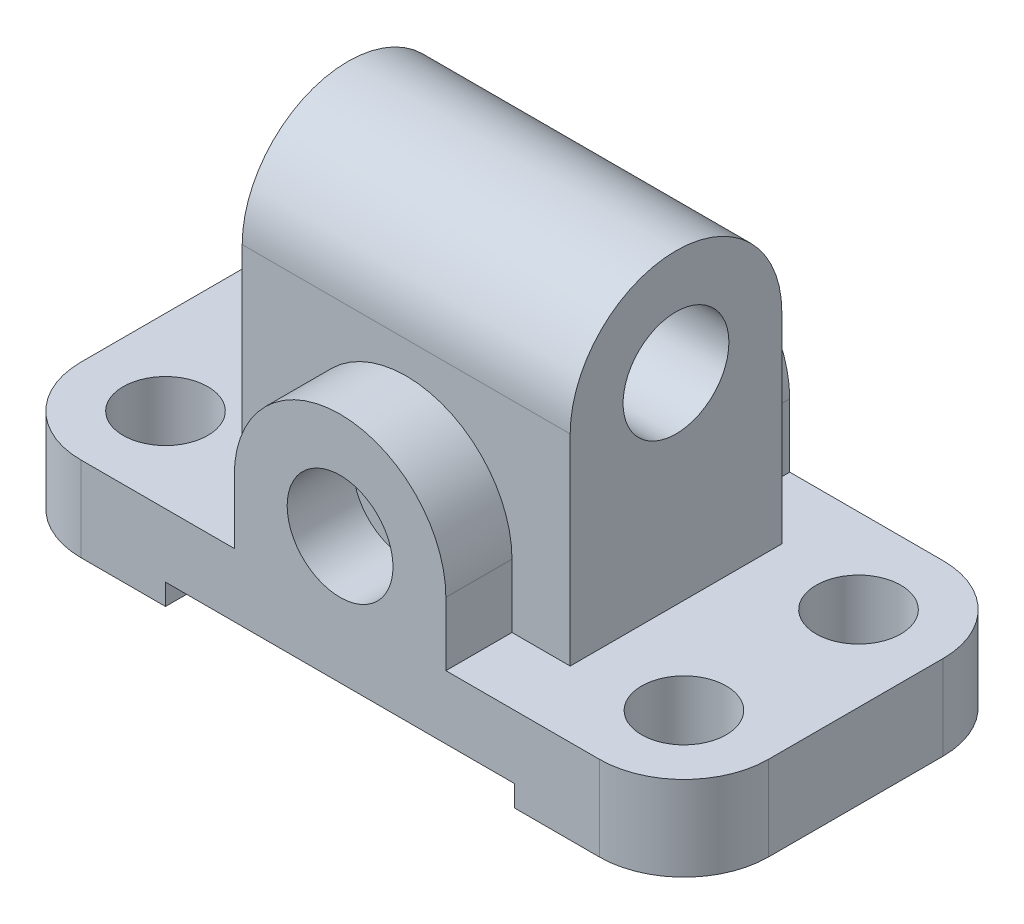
from build123d import *

# Parameters (mm, degrees)
EXTRUDE_1_DEPTH          = 32
EXTRUDE_3_DEPTH          = 62
EXTRUDE_3_DEPTH_BACK     = 62
SKETCH_3_R               = 20
SKETCH_4_R               = 20
EXTRUDE_4_DEPTH          = 25
SKETCH_5_R               = 16
CUT_EXTRUDE_1_DEPTH      = 186.959673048
MIRROR_2_COPY_1_SKETCH_R = 16
MIRROR_2_COPY_1_DEPTH    = 186.959673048
EXTRUDE_START            = 25
SKETCH_6_R               = 20
EXTRUDE_5_DEPTH          = 25
SKETCH_7_W               = 132
SKETCH_7_H               = 25.215611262
CUT_EXTRUDE_2_DEPTH      = 237.016948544


with BuildPart() as part:
    # Sketch 1 → Extrude 1 (new body)
    with BuildSketch(Plane(origin=(0, 0, 0), x_dir=(1, 0, 0), z_dir=(0, 1, 0))):
        with BuildLine():
            Line((98, -65), (-98, -65))
            ThreePointArc((-98, -65), (-120.627416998, -55.627416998), (-130, -33))
            Line((-130, -33), (-130, 33))
            ThreePointArc((-130, 33), (-120.627416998, 55.627416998), (-98, 65))
            Line((-98, 65), (98, 65))
            ThreePointArc((98, 65), (120.627416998, 55.627416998), (130, 33))
            Line((130, 33), (130, -33))
            ThreePointArc((130, -33), (120.627416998, -55.627416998), (98, -65))
        make_face()
    extrude(amount=EXTRUDE_1_DEPTH)

    # Sketch 3 → Extrude 3 (add, two sides: drawn at the far end of the back side and taken through both)
    with BuildSketch(Plane(origin=(0, 0, 0), x_dir=(0, 0, -1), z_dir=(1, 0, 0)).offset(-EXTRUDE_3_DEPTH_BACK)):
        with BuildLine():
            Line((40, 32), (-40, 32))
            Line((-40, 32), (-40, 108))
            ThreePointArc((-40, 108), (0, 148), (40, 108))
            Line((40, 108), (40, 32))
        make_face()
        with Locations((0, 108)):
            Circle(SKETCH_3_R, mode=Mode.SUBTRACT)
    extrude(amount=EXTRUDE_3_DEPTH + EXTRUDE_3_DEPTH_BACK)

    # Sketch 4 → Extrude 4 (add)
    with BuildSketch(Plane(origin=(0, 0, -40), x_dir=(-1, 0, 0), z_dir=(0, 0, -1))):
        with BuildLine():
            Line((-40, 32), (-40, 56))
            ThreePointArc((-40, 56), (0, 96), (40, 56))
            Line((40, 56), (40, 32))
            Line((40, 32), (-40, 32))
        make_face()
        with Locations(Location((0, 56, 0), (0, 0, 180))):
            Circle(SKETCH_4_R, mode=Mode.SUBTRACT)
    extrude(amount=EXTRUDE_4_DEPTH)

    # Sketch 5 → Cut-Extrude 1 (cut, through all)
    with BuildSketch(Plane(origin=(0, 32, 0), x_dir=(1, 0, 0), z_dir=(0, 1, 0))):
        with Locations(Location((-98, 33, 0), (0, 0, 270))):
            Circle(SKETCH_5_R)
    cut_extrude_1 = extrude(amount=-CUT_EXTRUDE_1_DEPTH, mode=Mode.SUBTRACT)

    # Mirror 1: Cut-Extrude 1 across plane
    add(cut_extrude_1.mirror(Plane.XY), mode=Mode.SUBTRACT)

    # Mirror 2: Cut-Extrude 1 across plane
    add(cut_extrude_1.mirror(Plane(origin=(0, 0, 0), x_dir=(0, 0, 1), z_dir=(1, 0, 0))), mode=Mode.SUBTRACT)

    # Mirror 2 copy 1 sketch → Mirror 2 copy 1 (cut, through all)
    with BuildSketch(Plane(origin=(0, 32, 0), x_dir=(-1, 0, 0), z_dir=(0, 1, 0))):
        with Locations(Location((-98, 33, 0), (0, 0, 270))):
            Circle(MIRROR_2_COPY_1_SKETCH_R)
    extrude(amount=-MIRROR_2_COPY_1_DEPTH, mode=Mode.SUBTRACT)

    # Sketch 6 → Extrude 5 (add)
    with BuildSketch(Plane.XY.offset(40).offset(EXTRUDE_START)):
        with BuildLine():
            Line((-40, 32), (-40, 56))
            ThreePointArc((-40, 56), (0, 96), (40, 56))
            Line((40, 56), (40, 32))
            Line((40, 32), (-40, 32))
        make_face()
        with Locations((0, 56)):
            Circle(SKETCH_6_R, mode=Mode.SUBTRACT)
    extrude(amount=-EXTRUDE_5_DEPTH)

    # Sketch 7 → Cut-Extrude 2 (cut, through all)
    with BuildSketch(Plane.XY.offset(65)):
        with Locations((0, -4.607805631)):
            Rectangle(SKETCH_7_W, SKETCH_7_H)
    extrude(amount=-CUT_EXTRUDE_2_DEPTH, mode=Mode.SUBTRACT)


solid = part.part
